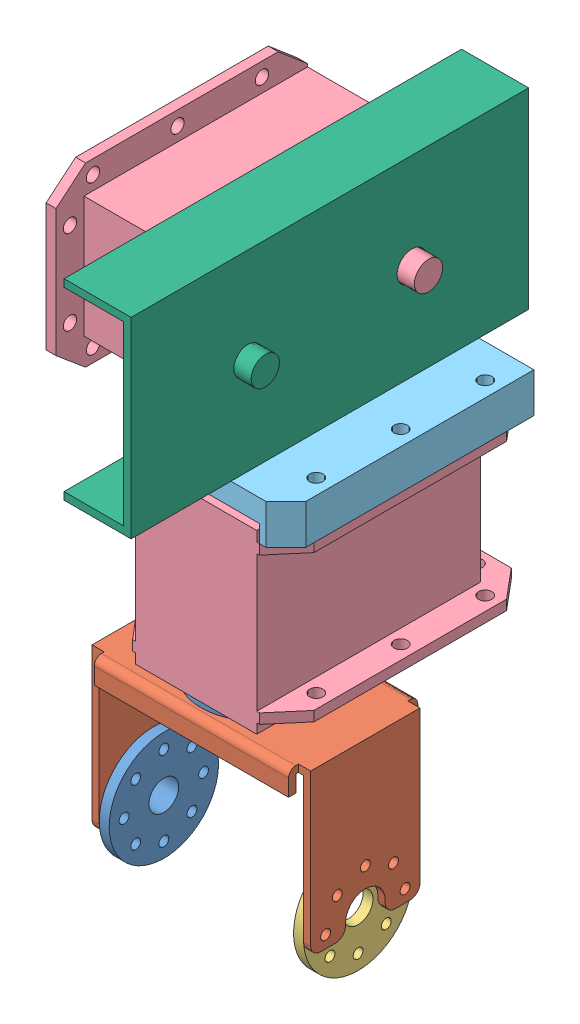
SolidWorks assembly X3_start.SLDASM, configuration Default (file format 8000). Lengths in mm.
Overall size (56.88 123.1 80).
10 component instances, 6 part files, 3 mates.
Components (placement in the parent):
- Segment4-1: Segment4.SLDASM [Default] at origin size (45.55 43 26)
  - Disk_driver1-1: Disk_driver1.SLDPRT [Default] at origin size (5 22 22)
  - Frame4-1: Frame4.SLDPRT [Default] at (41.55 13.7454 -0.0016) x (0 1 0) z (0 0 1) size (32.5 44 26)
  - Disk1-1: Disk1.SLDPRT [Default] at (39.1 0 0) size (2 22 22)
  - Disk_driver1-3: Disk_driver1.SLDPRT [Default] at (19.5 30.9954 -0.0016) x (0 1 0) z (1 0 0) size (5 22 22)
- Segment5-1: Segment5.SLDASM [Default] at (19.5 49.7454 -10.5016) x (1 0 0) z (0 -1 0) size (52.9 80 84.95)
  - Actuator1-1: Actuator1.SLDPRT [Default] at origin size (35.6 50.6 45.2)
  - Support-1: Support.SLDPRT [Default] at (0.2671 -4.8961 -19.75) x (0 -1 0) z (0 0 -1) size (49.9 35.6 8)
  - Keeper-1: Keeper.SLDPRT [Default] at (7.0171 2.6039 -43.05) x (0 0 -1) z (0 1 0) size (38.6 17 80)
  - Actuator1-2: Actuator1.SLDPRT [Default] at (-12.2329 -3.3961 -43.05) x (0 0 1) z (1 0 0) size (35.6 50.6 45.2)
Mates (geometry in assembly coordinates):
- Concentric1: concentric anti-aligned: cylinder of Segment4-1/Disk_driver1-3 through (19.5 30.9954 -0.0016) axis (0 -1 0) radius 3; cylinder of Segment5-1/Actuator1-1 through (19.5 27.1454 -0.0016) axis (0 1 0) radius 2.85
- Coincident1: coincident anti-aligned: plane of Segment4-1/Disk_driver1-3 through (19.5 31.9954 2.9984) normal (0 1 0); plane of Segment5-1/Actuator1-1 through (19.5 31.9954 -10.5016) normal (0 -1 0)
- Parallel1: parallel aligned: plane of Segment4-1/Frame4-1 through (41.55 -2.5046 10.9984) normal (1 0 0); plane of Segment5-1/Actuator1-1 through (31.7 31.9954 11.9984) normal (1 0 0)
